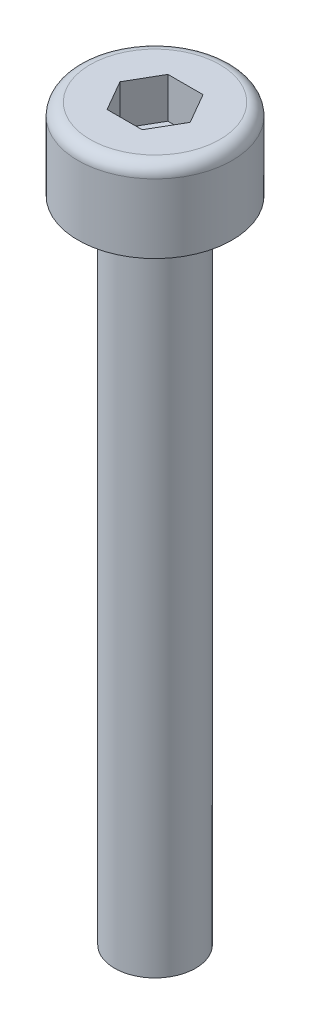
from build123d import *

# Parameters (mm, degrees)
SCHNITT_LINEAR_AUSTRAGEN1_DEPTH = 1


with BuildPart() as part:
    # Skizze1 → Rotation1 (revolve)
    with BuildSketch(Plane.XY, mode=Mode.PRIVATE) as rotation1_sk:
        with BuildLine():
            Line((0, 0), (-1, 0))
            Line((-1, 0), (-1, 16))
            Line((-1, 16), (-1.9, 16))
            Line((-1.9, 16), (-1.9, 17.7))
            ThreePointArc((-1.9, 17.7), (-1.812132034, 17.912132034), (-1.6, 18))
            Line((-1.6, 18), (0, 18))
            Line((0, 18), (0, 0))
        make_face()
    revolve(rotation1_sk.sketch.rotate(Axis((0, 0, 0), (0, 1, 0)), 270), axis=Axis((0, 0, 0), (0, 1, 0)))

    # Skizze2 → Schnitt-Linear austragen1 (cut)
    with BuildSketch(Plane(origin=(0, 18, 0), x_dir=(1, 0, 0), z_dir=(0, 1, 0))):
        Polygon((0.433012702, 0.75), (-0.433012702, 0.75), (-0.866025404, 0), (-0.433012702, -0.75), (0.433012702, -0.75), (0.866025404, 0), align=None)
    extrude(amount=-SCHNITT_LINEAR_AUSTRAGEN1_DEPTH, mode=Mode.SUBTRACT)


solid = part.part
